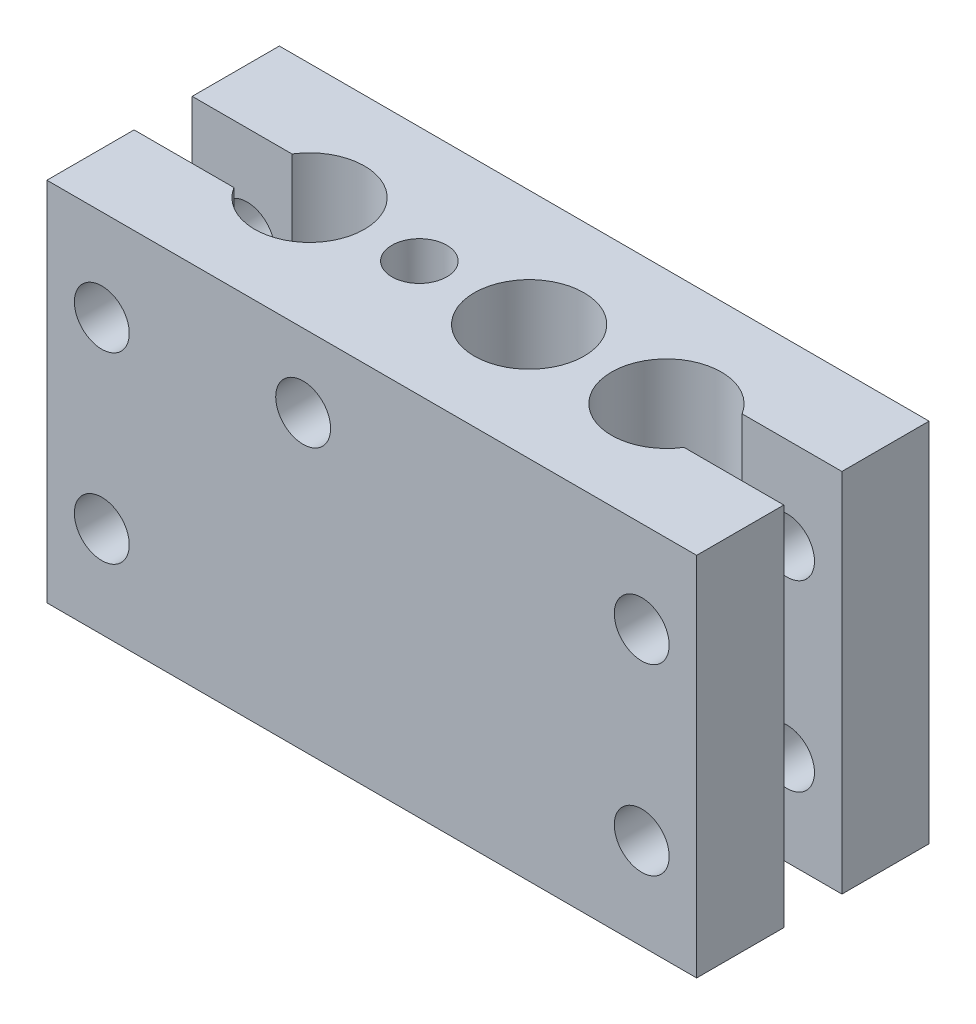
from build123d import *

# Parameters (mm, degrees)
SKETCH1_W               = 35.5
SKETCH1_H               = 20
BOSS_EXTRUDE1_DEPTH     = 6.35
CUT_EXTRUDE1_DEPTH      = 28.484268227
CUT_EXTRUDE1_DEPTH_BACK = 28.484268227
SKETCH2_R               = 3
SKETCH2_R_2             = 1.5
SKETCH2_W               = 5.454446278
SKETCH2_H               = 3.175
CUT_EXTRUDE2_DEPTH      = 25.007342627
CUT_EXTRUDE2_DEPTH_BACK = 25.007342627
SKETCH3_R               = 1.5


with BuildPart() as part:
    # Sketch1 → Boss-Extrude1 (new, symmetric)
    with BuildSketch(Plane.XY):
        Rectangle(SKETCH1_W, SKETCH1_H)
    extrude(amount=BOSS_EXTRUDE1_DEPTH, both=True)

    # Sketch2 → Cut-Extrude1 (cut, two sides: drawn at the far end of the back side and taken through both)
    with BuildSketch(Plane(origin=(0, 10, 0), x_dir=(1, 0, 0), z_dir=(0, 1, 0)).offset(-CUT_EXTRUDE1_DEPTH_BACK)):
        with BuildLine():
            ThreePointArc((12.75, 0), (12.634151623, -0.825632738), (12.295553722, -1.5875))
            Line((12.295553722, -1.5875), (17.75, -1.5875))
            Line((17.75, -1.5875), (17.75, 1.5875))
            Line((17.75, 1.5875), (12.295553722, 1.5875))
            ThreePointArc((12.295553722, 1.5875), (12.634151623, 0.825632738), (12.75, 0))
        make_face()
        with BuildLine():
            ThreePointArc((12.295553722, 1.5875), (6.75, 0), (12.295553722, -1.5875))
            Line((12.295553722, -1.5875), (12.295553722, 1.5875))
        make_face()
        with BuildLine():
            Line((12.295553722, 1.5875), (12.295553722, -1.5875))
            ThreePointArc((12.295553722, -1.5875), (12.634151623, -0.825632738), (12.75, 0))
            ThreePointArc((12.75, 0), (12.634151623, 0.825632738), (12.295553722, 1.5875))
        make_face()
        with Locations(Location((2.25, 0, 0), (0, 0, 270))):
            Circle(SKETCH2_R)
        with Locations(Location((-3.75, 0, 0), (0, 0, 270))):
            Circle(SKETCH2_R_2)
        with Locations((-9.75, 0)):
            Circle(SKETCH2_R)
        with Locations((-15.022776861, 0)):
            Rectangle(SKETCH2_W, SKETCH2_H)
    extrude(amount=CUT_EXTRUDE1_DEPTH + CUT_EXTRUDE1_DEPTH_BACK, mode=Mode.SUBTRACT)

    # Sketch3 → Cut-Extrude2 (cut, two sides: drawn at the far end of the back side and taken through both)
    with BuildSketch(Plane.XY.offset(6.35).offset(-CUT_EXTRUDE2_DEPTH_BACK)):
        with Locations((14.75, 5)):
            Circle(SKETCH3_R)
        with Locations((14.75, -5)):
            Circle(SKETCH3_R)
        with Locations(Location((-3.75, 6, 0), (0, 0, 180))):
            Circle(SKETCH3_R)
        with Locations(Location((-14.75, -5, 0), (0, 0, 180))):
            Circle(SKETCH3_R)
        with Locations(Location((-14.75, 5, 0), (0, 0, 180))):
            Circle(SKETCH3_R)
    extrude(amount=CUT_EXTRUDE2_DEPTH + CUT_EXTRUDE2_DEPTH_BACK, mode=Mode.SUBTRACT)


solid = part.part
